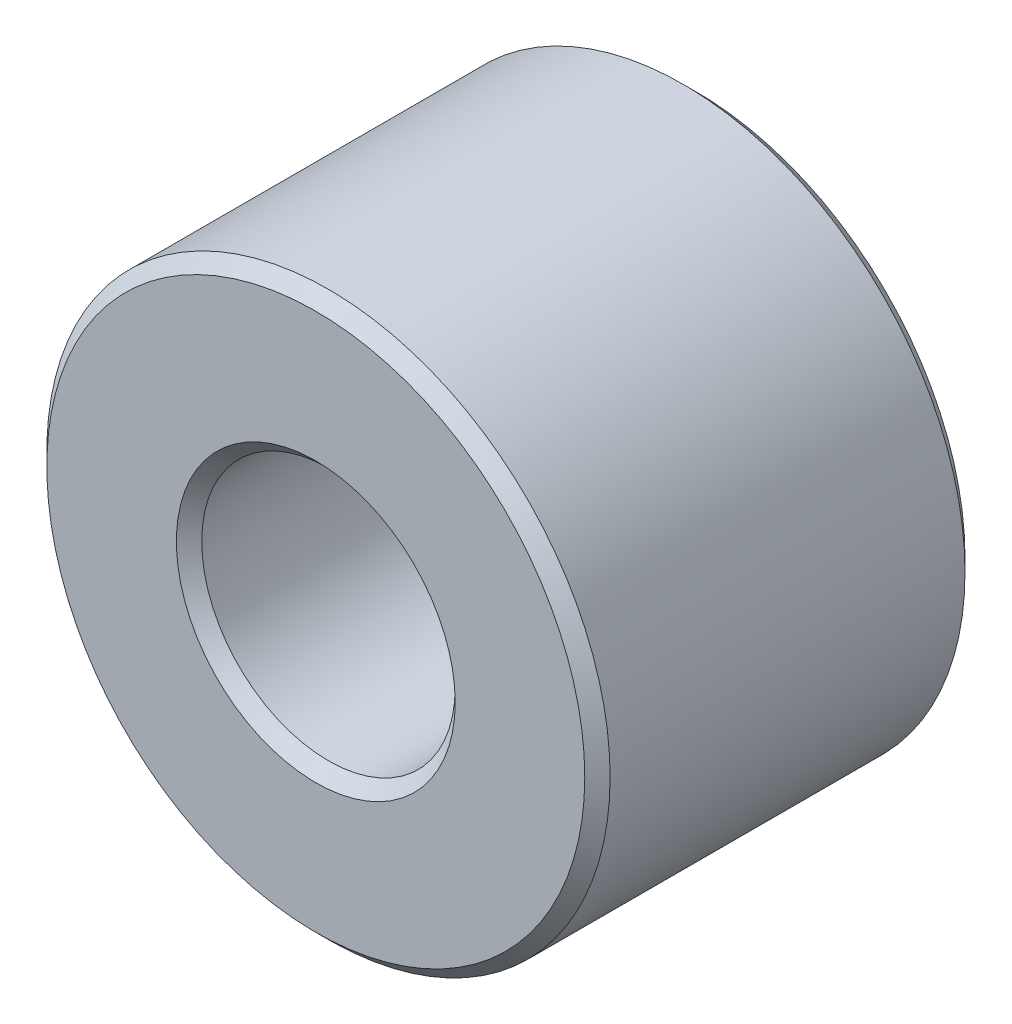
ISO-10303-21;
HEADER;
FILE_DESCRIPTION(('STEP AP214'),'2;1');
FILE_NAME('part.step','',(''),(''),'','','');
FILE_SCHEMA(('AUTOMOTIVE_DESIGN { 1 0 10303 214 1 1 1 1 }'));
ENDSEC;
DATA;
#1=APPLICATION_CONTEXT('core data for automotive mechanical design processes');
#2=APPLICATION_PROTOCOL_DEFINITION('international standard','automotive_design',2000,#1);
#3=PRODUCT_CONTEXT('',#1,'mechanical');
#4=PRODUCT('Part','Part','',(#3));
#5=PRODUCT_RELATED_PRODUCT_CATEGORY('part','',(#4));
#6=PRODUCT_DEFINITION_FORMATION('','',#4);
#7=PRODUCT_DEFINITION_CONTEXT('part definition',#1,'design');
#8=PRODUCT_DEFINITION('design','',#6,#7);
#9=PRODUCT_DEFINITION_SHAPE('','',#8);
#10=(LENGTH_UNIT() NAMED_UNIT(*) SI_UNIT(.MILLI.,.METRE.));
#11=(NAMED_UNIT(*) PLANE_ANGLE_UNIT() SI_UNIT($,.RADIAN.));
#12=(NAMED_UNIT(*) SI_UNIT($,.STERADIAN.) SOLID_ANGLE_UNIT());
#13=UNCERTAINTY_MEASURE_WITH_UNIT(LENGTH_MEASURE(1.E-05),#10,'distance_accuracy_value','');
#14=(GEOMETRIC_REPRESENTATION_CONTEXT(3) GLOBAL_UNCERTAINTY_ASSIGNED_CONTEXT((#13)) GLOBAL_UNIT_ASSIGNED_CONTEXT((#10,
#11,#12)) REPRESENTATION_CONTEXT('',''));
#15=CARTESIAN_POINT('',(0.,0.,0.));
#16=DIRECTION('',(0.,0.,1.));
#17=DIRECTION('',(1.,0.,0.));
#18=AXIS2_PLACEMENT_3D('',#15,#16,#17);
#19=CARTESIAN_POINT('',(0.,0.,13.5));
#20=DIRECTION('',(0.,0.,1.));
#21=DIRECTION('',(1.,0.,0.));
#22=AXIS2_PLACEMENT_3D('',#19,#20,#21);
#23=PLANE('',#22);
#24=CARTESIAN_POINT('',(0.,0.,13.5));
#25=DIRECTION('',(0.,0.,1.));
#26=DIRECTION('',(1.,0.,0.));
#27=AXIS2_PLACEMENT_3D('',#24,#25,#26);
#28=CIRCLE('',#27,9.9);
#29=CARTESIAN_POINT('',(9.9,0.,13.5));
#30=VERTEX_POINT('',#29);
#31=EDGE_CURVE('E10',#30,#30,#28,.F.);
#32=ORIENTED_EDGE('',*,*,#31,.T.);
#33=EDGE_LOOP('',(#32));
#34=FACE_BOUND('',#33,.T.);
#35=CARTESIAN_POINT('',(0.,0.,13.5));
#36=DIRECTION('',(0.,0.,1.));
#37=DIRECTION('',(1.,0.,0.));
#38=AXIS2_PLACEMENT_3D('',#35,#36,#37);
#39=CIRCLE('',#38,19.1);
#40=CARTESIAN_POINT('',(19.1,0.,13.5));
#41=VERTEX_POINT('',#40);
#42=EDGE_CURVE('E40',#41,#41,#39,.T.);
#43=ORIENTED_EDGE('',*,*,#42,.T.);
#44=EDGE_LOOP('',(#43));
#45=FACE_BOUND('',#44,.T.);
#46=ADVANCED_FACE('F33',(#34,#45),#23,.T.);
#47=CARTESIAN_POINT('',(0.,0.,-13.5));
#48=DIRECTION('',(0.,0.,1.));
#49=DIRECTION('',(1.,0.,0.));
#50=AXIS2_PLACEMENT_3D('',#47,#48,#49);
#51=PLANE('',#50);
#52=CARTESIAN_POINT('',(0.,0.,-13.5));
#53=DIRECTION('',(0.,0.,1.));
#54=DIRECTION('',(1.,0.,0.));
#55=AXIS2_PLACEMENT_3D('',#52,#53,#54);
#56=CIRCLE('',#55,9.90000000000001);
#57=CARTESIAN_POINT('',(-9.90000000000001,0.,-13.5));
#58=VERTEX_POINT('',#57);
#59=EDGE_CURVE('E59',#58,#58,#56,.T.);
#60=ORIENTED_EDGE('',*,*,#59,.T.);
#61=EDGE_LOOP('',(#60));
#62=FACE_BOUND('',#61,.T.);
#63=CARTESIAN_POINT('',(0.,0.,-13.5));
#64=DIRECTION('',(0.,0.,1.));
#65=DIRECTION('',(1.,0.,0.));
#66=AXIS2_PLACEMENT_3D('',#63,#64,#65);
#67=CIRCLE('',#66,19.1);
#68=CARTESIAN_POINT('',(19.1,0.,-13.5));
#69=VERTEX_POINT('',#68);
#70=EDGE_CURVE('E62',#69,#69,#67,.F.);
#71=ORIENTED_EDGE('',*,*,#70,.T.);
#72=EDGE_LOOP('',(#71));
#73=FACE_BOUND('',#72,.T.);
#74=ADVANCED_FACE('F66',(#62,#73),#51,.F.);
#75=CARTESIAN_POINT('',(0.,0.,13.5));
#76=DIRECTION('',(0.,0.,-1.));
#77=DIRECTION('',(-1.,0.,0.));
#78=AXIS2_PLACEMENT_3D('',#75,#76,#77);
#79=CYLINDRICAL_SURFACE('',#78,20.);
#80=CARTESIAN_POINT('',(0.,0.,-12.6));
#81=DIRECTION('',(0.,0.,1.));
#82=DIRECTION('',(1.,0.,0.));
#83=AXIS2_PLACEMENT_3D('',#80,#81,#82);
#84=CIRCLE('',#83,20.);
#85=CARTESIAN_POINT('',(20.,0.,-12.6));
#86=VERTEX_POINT('',#85);
#87=EDGE_CURVE('E44',#86,#86,#84,.T.);
#88=ORIENTED_EDGE('',*,*,#87,.T.);
#89=EDGE_LOOP('',(#88));
#90=FACE_BOUND('',#89,.T.);
#91=CARTESIAN_POINT('',(0.,0.,12.6));
#92=DIRECTION('',(0.,0.,1.));
#93=DIRECTION('',(1.,0.,0.));
#94=AXIS2_PLACEMENT_3D('',#91,#92,#93);
#95=CIRCLE('',#94,20.);
#96=CARTESIAN_POINT('',(20.,0.,12.6));
#97=VERTEX_POINT('',#96);
#98=EDGE_CURVE('E48',#97,#97,#95,.F.);
#99=ORIENTED_EDGE('',*,*,#98,.T.);
#100=EDGE_LOOP('',(#99));
#101=FACE_BOUND('',#100,.T.);
#102=ADVANCED_FACE('F76',(#90,#101),#79,.T.);
#103=CARTESIAN_POINT('',(0.,0.,13.5));
#104=DIRECTION('',(0.,0.,-1.));
#105=DIRECTION('',(-1.,0.,0.));
#106=AXIS2_PLACEMENT_3D('',#103,#104,#105);
#107=CYLINDRICAL_SURFACE('',#106,9.);
#108=CARTESIAN_POINT('',(0.,0.,-12.6));
#109=DIRECTION('',(0.,0.,1.));
#110=DIRECTION('',(1.,0.,0.));
#111=AXIS2_PLACEMENT_3D('',#108,#109,#110);
#112=CIRCLE('',#111,9.);
#113=CARTESIAN_POINT('',(-9.,0.,-12.6));
#114=VERTEX_POINT('',#113);
#115=EDGE_CURVE('E53',#114,#114,#112,.F.);
#116=ORIENTED_EDGE('',*,*,#115,.T.);
#117=EDGE_LOOP('',(#116));
#118=FACE_BOUND('',#117,.T.);
#119=CARTESIAN_POINT('',(0.,0.,12.6));
#120=DIRECTION('',(0.,0.,1.));
#121=DIRECTION('',(1.,0.,0.));
#122=AXIS2_PLACEMENT_3D('',#119,#120,#121);
#123=CIRCLE('',#122,9.);
#124=CARTESIAN_POINT('',(9.,0.,12.6));
#125=VERTEX_POINT('',#124);
#126=EDGE_CURVE('E56',#125,#125,#123,.T.);
#127=ORIENTED_EDGE('',*,*,#126,.T.);
#128=EDGE_LOOP('',(#127));
#129=FACE_BOUND('',#128,.T.);
#130=ADVANCED_FACE('F79',(#118,#129),#107,.F.);
#131=CARTESIAN_POINT('',(0.,0.,-13.5));
#132=DIRECTION('',(0.,0.,-1.));
#133=DIRECTION('',(-1.,0.,0.));
#134=AXIS2_PLACEMENT_3D('',#131,#132,#133);
#135=CONICAL_SURFACE('',#134,9.90000000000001,0.785398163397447);
#136=CARTESIAN_POINT('',(-9.,0.,-12.6));
#137=CARTESIAN_POINT('',(-9.009375,0.,-12.609375));
#138=CARTESIAN_POINT('',(-9.01875,0.,-12.61875));
#139=CARTESIAN_POINT('',(-9.0375,0.,-12.6375));
#140=CARTESIAN_POINT('',(-9.046875,0.,-12.646875));
#141=CARTESIAN_POINT('',(-9.065625,0.,-12.665625));
#142=CARTESIAN_POINT('',(-9.075,0.,-12.675));
#143=CARTESIAN_POINT('',(-9.09375,0.,-12.69375));
#144=CARTESIAN_POINT('',(-9.103125,0.,-12.703125));
#145=CARTESIAN_POINT('',(-9.121875,0.,-12.721875));
#146=CARTESIAN_POINT('',(-9.13125,0.,-12.73125));
#147=CARTESIAN_POINT('',(-9.15,0.,-12.75));
#148=CARTESIAN_POINT('',(-9.159375,0.,-12.759375));
#149=CARTESIAN_POINT('',(-9.178125,0.,-12.778125));
#150=CARTESIAN_POINT('',(-9.1875,0.,-12.7875));
#151=CARTESIAN_POINT('',(-9.20625,0.,-12.80625));
#152=CARTESIAN_POINT('',(-9.215625,0.,-12.815625));
#153=CARTESIAN_POINT('',(-9.234375,0.,-12.834375));
#154=CARTESIAN_POINT('',(-9.24375,0.,-12.84375));
#155=CARTESIAN_POINT('',(-9.2625,0.,-12.8625));
#156=CARTESIAN_POINT('',(-9.271875,0.,-12.871875));
#157=CARTESIAN_POINT('',(-9.290625,0.,-12.890625));
#158=CARTESIAN_POINT('',(-9.3,0.,-12.9));
#159=CARTESIAN_POINT('',(-9.31875,0.,-12.91875));
#160=CARTESIAN_POINT('',(-9.328125,0.,-12.928125));
#161=CARTESIAN_POINT('',(-9.346875,0.,-12.946875));
#162=CARTESIAN_POINT('',(-9.35625,0.,-12.95625));
#163=CARTESIAN_POINT('',(-9.375,0.,-12.975));
#164=CARTESIAN_POINT('',(-9.384375,0.,-12.984375));
#165=CARTESIAN_POINT('',(-9.403125,0.,-13.003125));
#166=CARTESIAN_POINT('',(-9.4125,0.,-13.0125));
#167=CARTESIAN_POINT('',(-9.43125,0.,-13.03125));
#168=CARTESIAN_POINT('',(-9.440625,0.,-13.040625));
#169=CARTESIAN_POINT('',(-9.459375,0.,-13.059375));
#170=CARTESIAN_POINT('',(-9.46875,0.,-13.06875));
#171=CARTESIAN_POINT('',(-9.4875,0.,-13.0875));
#172=CARTESIAN_POINT('',(-9.496875,0.,-13.096875));
#173=CARTESIAN_POINT('',(-9.51562500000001,0.,-13.115625));
#174=CARTESIAN_POINT('',(-9.525,0.,-13.125));
#175=CARTESIAN_POINT('',(-9.54375,0.,-13.14375));
#176=CARTESIAN_POINT('',(-9.553125,0.,-13.153125));
#177=CARTESIAN_POINT('',(-9.571875,0.,-13.171875));
#178=CARTESIAN_POINT('',(-9.58125,0.,-13.18125));
#179=CARTESIAN_POINT('',(-9.6,0.,-13.2));
#180=CARTESIAN_POINT('',(-9.609375,0.,-13.209375));
#181=CARTESIAN_POINT('',(-9.628125,0.,-13.228125));
#182=CARTESIAN_POINT('',(-9.6375,0.,-13.2375));
#183=CARTESIAN_POINT('',(-9.65625000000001,0.,-13.25625));
#184=CARTESIAN_POINT('',(-9.665625,0.,-13.265625));
#185=CARTESIAN_POINT('',(-9.684375,0.,-13.284375));
#186=CARTESIAN_POINT('',(-9.69375,0.,-13.29375));
#187=CARTESIAN_POINT('',(-9.71250000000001,0.,-13.3125));
#188=CARTESIAN_POINT('',(-9.721875,0.,-13.321875));
#189=CARTESIAN_POINT('',(-9.74062500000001,0.,-13.340625));
#190=CARTESIAN_POINT('',(-9.75000000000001,0.,-13.35));
#191=CARTESIAN_POINT('',(-9.76875000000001,0.,-13.36875));
#192=CARTESIAN_POINT('',(-9.77812500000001,0.,-13.378125));
#193=CARTESIAN_POINT('',(-9.79687500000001,0.,-13.396875));
#194=CARTESIAN_POINT('',(-9.80625000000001,0.,-13.40625));
#195=CARTESIAN_POINT('',(-9.82500000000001,0.,-13.425));
#196=CARTESIAN_POINT('',(-9.83437500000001,0.,-13.434375));
#197=CARTESIAN_POINT('',(-9.85312500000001,0.,-13.453125));
#198=CARTESIAN_POINT('',(-9.86250000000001,0.,-13.4625));
#199=CARTESIAN_POINT('',(-9.88125000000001,0.,-13.48125));
#200=CARTESIAN_POINT('',(-9.89062500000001,0.,-13.490625));
#201=CARTESIAN_POINT('',(-9.90000000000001,0.,-13.5));
#202=B_SPLINE_CURVE_WITH_KNOTS('',3,(#136,#137,#138,#139,#140,#141,#142,#143,#144,#145,#146,
#147,#148,#149,#150,#151,#152,#153,#154,#155,#156,#157,#158,#159,#160,#161,#162,#163,#164,#165,
#166,#167,#168,#169,#170,#171,#172,#173,#174,#175,#176,#177,#178,#179,#180,#181,#182,#183,#184,
#185,#186,#187,#188,#189,#190,#191,#192,#193,#194,#195,#196,#197,#198,#199,#200,#201),
.UNSPECIFIED.,.F.,.F.,(4,2,2,2,2,2,2,2,2,2,2,2,2,2,2,2,2,2,2,2,2,2,2,2,2,2,2,2,2,2,2,2,4),(0.,
0.0397747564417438,0.0795495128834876,0.119324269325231,0.159099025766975,0.198873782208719,
0.238648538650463,0.278423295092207,0.318198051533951,0.357972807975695,0.397747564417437,
0.437522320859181,0.477297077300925,0.517071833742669,0.556846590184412,0.596621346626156,
0.636396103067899,0.676170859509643,0.715945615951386,0.75572037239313,0.795495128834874,
0.835269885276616,0.87504464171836,0.914819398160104,0.954594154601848,0.994368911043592,
1.03414366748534,1.07391842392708,1.11369318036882,1.15346793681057,1.19324269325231,
1.23301744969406,1.2727922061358),.UNSPECIFIED.);
#203=EDGE_CURVE('BSEAM72',#114,#58,#202,.T.);
#204=ORIENTED_EDGE('',*,*,#115,.F.);
#205=ORIENTED_EDGE('',*,*,#59,.F.);
#206=ORIENTED_EDGE('',*,*,#203,.T.);
#207=ORIENTED_EDGE('',*,*,#203,.F.);
#208=EDGE_LOOP('',(#204,#206,#205,#207));
#209=FACE_BOUND('',#208,.T.);
#210=ADVANCED_FACE('F72',(#209),#135,.F.);
#211=CARTESIAN_POINT('',(0.,0.,-12.6));
#212=DIRECTION('',(0.,0.,1.));
#213=DIRECTION('',(1.,0.,0.));
#214=AXIS2_PLACEMENT_3D('',#211,#212,#213);
#215=CONICAL_SURFACE('',#214,20.,0.785398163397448);
#216=ORIENTED_EDGE('',*,*,#70,.F.);
#217=EDGE_LOOP('',(#216));
#218=FACE_BOUND('',#217,.T.);
#219=ORIENTED_EDGE('',*,*,#87,.F.);
#220=EDGE_LOOP('',(#219));
#221=FACE_BOUND('',#220,.T.);
#222=ADVANCED_FACE('F68',(#218,#221),#215,.T.);
#223=CARTESIAN_POINT('',(0.,0.,12.6));
#224=DIRECTION('',(0.,0.,1.));
#225=DIRECTION('',(1.,0.,0.));
#226=AXIS2_PLACEMENT_3D('',#223,#224,#225);
#227=CONICAL_SURFACE('',#226,9.,0.785398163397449);
#228=ORIENTED_EDGE('',*,*,#31,.F.);
#229=EDGE_LOOP('',(#228));
#230=FACE_BOUND('',#229,.T.);
#231=ORIENTED_EDGE('',*,*,#126,.F.);
#232=EDGE_LOOP('',(#231));
#233=FACE_BOUND('',#232,.T.);
#234=ADVANCED_FACE('F71',(#230,#233),#227,.F.);
#235=CARTESIAN_POINT('',(0.,0.,13.5));
#236=DIRECTION('',(0.,0.,-1.));
#237=DIRECTION('',(-1.,0.,0.));
#238=AXIS2_PLACEMENT_3D('',#235,#236,#237);
#239=CONICAL_SURFACE('',#238,19.1,0.78539816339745);
#240=ORIENTED_EDGE('',*,*,#98,.F.);
#241=EDGE_LOOP('',(#240));
#242=FACE_BOUND('',#241,.T.);
#243=ORIENTED_EDGE('',*,*,#42,.F.);
#244=EDGE_LOOP('',(#243));
#245=FACE_BOUND('',#244,.T.);
#246=ADVANCED_FACE('F35',(#242,#245),#239,.T.);
#247=CLOSED_SHELL('',(#46,#74,#102,#130,#210,#222,#234,#246));
#248=MANIFOLD_SOLID_BREP('B2',#247);
#249=ADVANCED_BREP_SHAPE_REPRESENTATION('',(#18,#248),#14);
#250=SHAPE_DEFINITION_REPRESENTATION(#9,#249);
ENDSEC;
END-ISO-10303-21;
